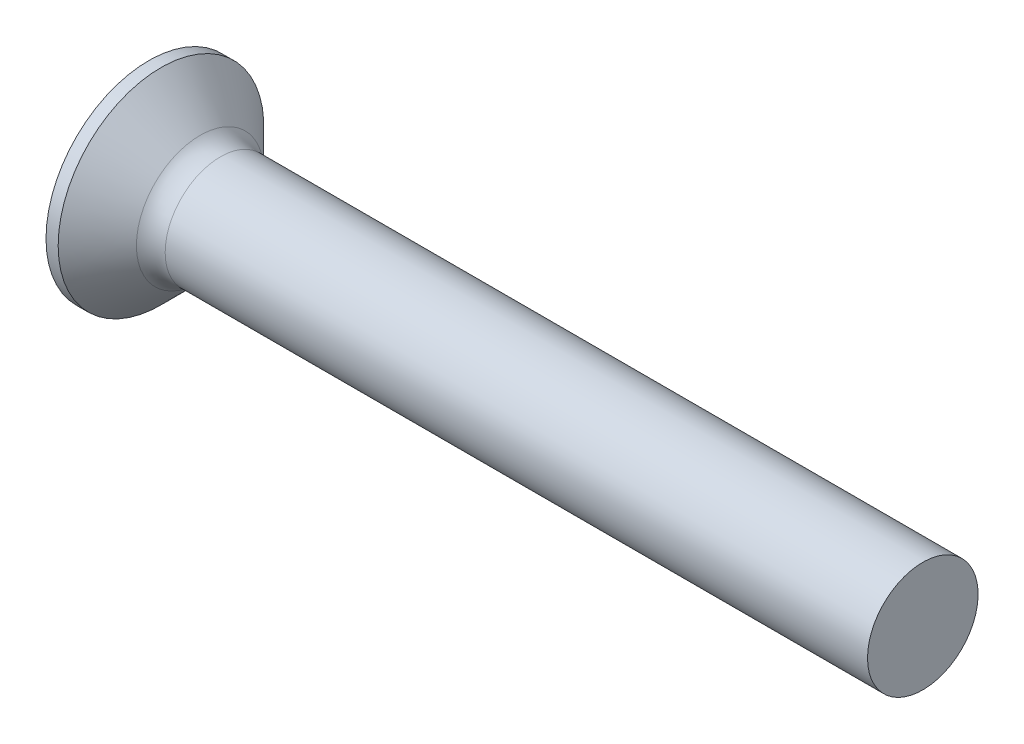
from build123d import *

# Parameters (mm, degrees)
FILLET1_R    = 1.3
RECPAT_COUNT = 2
RECPAT_ANGLE = 90


with BuildPart() as part:
    # BodySke → Base-Revolve (revolve)
    with BuildSketch(Plane.XY, mode=Mode.PRIVATE) as base_revolve_sk:
        Polygon((0, 0), (0, 4.65), (0.55, 4.65), (2.7, 2.5), (35, 2.5), (35, 0), align=None)
    revolve(base_revolve_sk.sketch.rotate(Axis((-6.35, 0, 0), (1, 0, 0)), 90), axis=Axis((-6.35, 0, 0), (1, 0, 0)))

    # Fillet1
    fillet1_edges = [part.edges().sort_by_distance(p)[0] for p in [
        (2.7, 0, -2.5),
    ]]
    fillet(fillet1_edges, radius=FILLET1_R)

    # Sketch3 → Recess section 0
    with BuildSketch(Plane.ZY):
        with BuildLine():
            Line((-0.515, 2.45), (0.515, 2.45))
            Line((0.515, 2.45), (0.515, -2.45))
            Line((0.515, -2.45), (-0.515, -2.45))
            Line((-0.515, -2.45), (-0.515, 2.45))
        make_face()
    # Sketch4 → Recess section 1
    with BuildSketch(Plane.ZY.offset(-3.05)):
        with BuildLine():
            Line((-0.515, 0.92932635), (0.515, 0.92932635))
            Line((0.515, 0.92932635), (0.515, -0.92932635))
            Line((0.515, -0.92932635), (-0.515, -0.92932635))
            Line((-0.515, -0.92932635), (-0.515, 0.92932635))
        make_face()
    recess = loft(mode=Mode.SUBTRACT)

    # RecPat: Recess ×2 about axis
    recpat_axis = Axis((0, 0, 0), (1, 0, 0))
    for i in range(1, RECPAT_COUNT):
        add(recess.rotate(recpat_axis, i * RECPAT_ANGLE / (RECPAT_COUNT - 1)), mode=Mode.SUBTRACT)

    # RecCorSke → RecessCore (revolve, cut)
    with BuildSketch(Plane.XY, mode=Mode.PRIVATE) as recesscore_sk:
        Polygon((0, 0), (0, 1.064276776), (3.05, 0.851), (3.326506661, 0), align=None)
    revolve(recesscore_sk.sketch.rotate(Axis((-3.175, 0, 0), (1, 0, 0)), 90), axis=Axis((-3.175, 0, 0), (1, 0, 0)), mode=Mode.SUBTRACT)


solid = part.part
